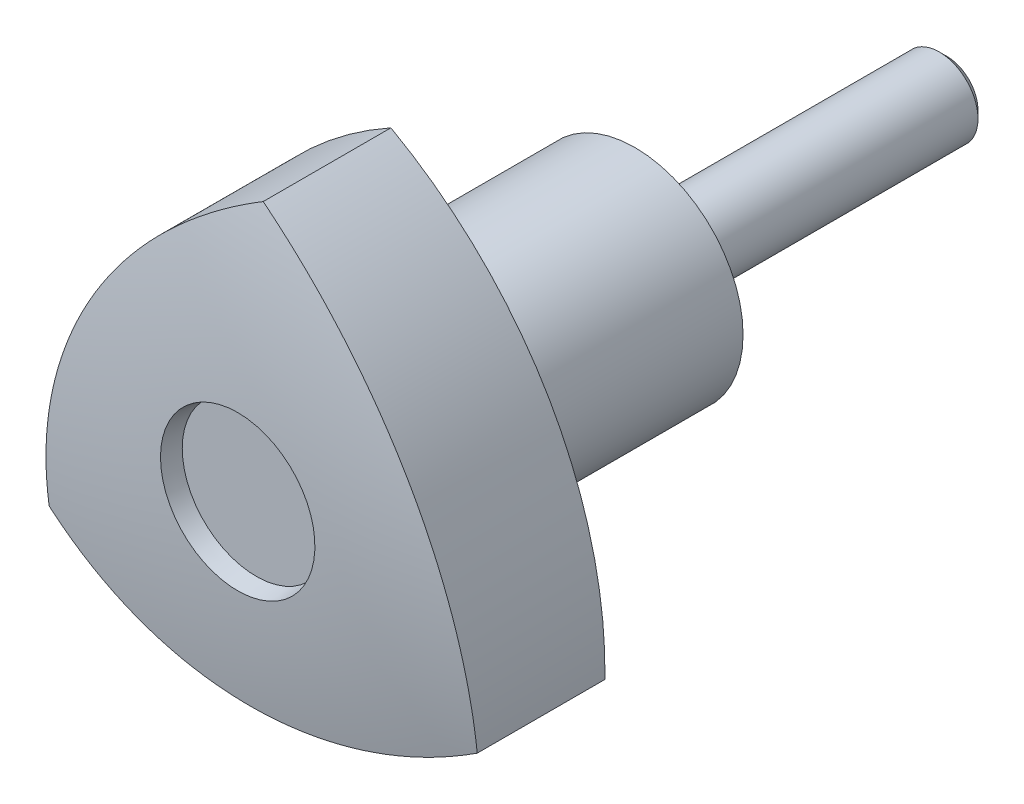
ISO-10303-21;
HEADER;
FILE_DESCRIPTION(('STEP AP214'),'2;1');
FILE_NAME('part.step','',(''),(''),'','','');
FILE_SCHEMA(('AUTOMOTIVE_DESIGN { 1 0 10303 214 1 1 1 1 }'));
ENDSEC;
DATA;
#1=APPLICATION_CONTEXT('core data for automotive mechanical design processes');
#2=APPLICATION_PROTOCOL_DEFINITION('international standard','automotive_design',2000,#1);
#3=PRODUCT_CONTEXT('',#1,'mechanical');
#4=PRODUCT('Part','Part','',(#3));
#5=PRODUCT_RELATED_PRODUCT_CATEGORY('part','',(#4));
#6=PRODUCT_DEFINITION_FORMATION('','',#4);
#7=PRODUCT_DEFINITION_CONTEXT('part definition',#1,'design');
#8=PRODUCT_DEFINITION('design','',#6,#7);
#9=PRODUCT_DEFINITION_SHAPE('','',#8);
#10=(LENGTH_UNIT() NAMED_UNIT(*) SI_UNIT(.MILLI.,.METRE.));
#11=(NAMED_UNIT(*) PLANE_ANGLE_UNIT() SI_UNIT($,.RADIAN.));
#12=(NAMED_UNIT(*) SI_UNIT($,.STERADIAN.) SOLID_ANGLE_UNIT());
#13=UNCERTAINTY_MEASURE_WITH_UNIT(LENGTH_MEASURE(1.E-05),#10,'distance_accuracy_value','');
#14=(GEOMETRIC_REPRESENTATION_CONTEXT(3) GLOBAL_UNCERTAINTY_ASSIGNED_CONTEXT((#13)) GLOBAL_UNIT_ASSIGNED_CONTEXT((#10,
#11,#12)) REPRESENTATION_CONTEXT('',''));
#15=CARTESIAN_POINT('',(0.,0.,0.));
#16=DIRECTION('',(0.,0.,1.));
#17=DIRECTION('',(1.,0.,0.));
#18=AXIS2_PLACEMENT_3D('',#15,#16,#17);
#19=CARTESIAN_POINT('',(0.,-3.25,16.));
#20=DIRECTION('',(0.,0.,-1.));
#21=DIRECTION('',(1.,0.,0.));
#22=AXIS2_PLACEMENT_3D('',#19,#20,#21);
#23=PLANE('',#22);
#24=CARTESIAN_POINT('',(0.,0.,16.0000000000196));
#25=DIRECTION('',(0.,0.,1.));
#26=DIRECTION('',(-1.,0.,0.));
#27=AXIS2_PLACEMENT_3D('',#24,#25,#26);
#28=CIRCLE('',#27,3.2499999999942);
#29=CARTESIAN_POINT('',(-3.2499999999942,0.,16.0000000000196));
#30=VERTEX_POINT('',#29);
#31=EDGE_CURVE('E19',#30,#30,#28,.T.);
#32=ORIENTED_EDGE('',*,*,#31,.T.);
#33=EDGE_LOOP('',(#32));
#34=FACE_BOUND('',#33,.T.);
#35=ADVANCED_FACE('F14',(#34),#23,.F.);
#36=CARTESIAN_POINT('',(0.,0.,23.8666666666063));
#37=DIRECTION('',(0.,0.,1.));
#38=DIRECTION('',(-1.,0.,0.));
#39=AXIS2_PLACEMENT_3D('',#36,#37,#38);
#40=CONICAL_SURFACE('',#39,4.63710558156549,0.174532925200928);
#41=CARTESIAN_POINT('',(0.,0.,23.8666666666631));
#42=DIRECTION('',(0.,0.,1.));
#43=DIRECTION('',(-1.,0.,0.));
#44=AXIS2_PLACEMENT_3D('',#41,#42,#43);
#45=CIRCLE('',#44,4.63710558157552);
#46=CARTESIAN_POINT('',(-4.63710558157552,0.,23.8666666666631));
#47=VERTEX_POINT('',#46);
#48=EDGE_CURVE('E138',#47,#47,#45,.T.);
#49=ORIENTED_EDGE('',*,*,#48,.T.);
#50=EDGE_LOOP('',(#49));
#51=FACE_BOUND('',#50,.T.);
#52=ORIENTED_EDGE('',*,*,#31,.F.);
#53=EDGE_LOOP('',(#52));
#54=FACE_BOUND('',#53,.T.);
#55=ADVANCED_FACE('F146',(#51,#54),#40,.F.);
#56=CARTESIAN_POINT('',(0.,-0.000999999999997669,23.8666666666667));
#57=DIRECTION('',(0.,0.,1.));
#58=DIRECTION('',(-1.,0.,0.));
#59=AXIS2_PLACEMENT_3D('',#56,#57,#58);
#60=PLANE('',#59);
#61=CARTESIAN_POINT('',(0.,0.,23.8666666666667));
#62=DIRECTION('',(0.,0.,-1.));
#63=DIRECTION('',(1.,0.,0.));
#64=AXIS2_PLACEMENT_3D('',#61,#62,#63);
#65=CIRCLE('',#64,0.0009999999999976);
#66=CARTESIAN_POINT('',(0.0009999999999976,0.,23.8666666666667));
#67=VERTEX_POINT('',#66);
#68=EDGE_CURVE('E136',#67,#67,#65,.F.);
#69=ORIENTED_EDGE('',*,*,#68,.T.);
#70=EDGE_LOOP('',(#69));
#71=FACE_BOUND('',#70,.T.);
#72=ORIENTED_EDGE('',*,*,#48,.F.);
#73=EDGE_LOOP('',(#72));
#74=FACE_BOUND('',#73,.T.);
#75=ADVANCED_FACE('F148',(#71,#74),#60,.F.);
#76=CARTESIAN_POINT('',(0.,0.,16.));
#77=DIRECTION('',(0.,0.,-1.));
#78=DIRECTION('',(1.,0.,0.));
#79=AXIS2_PLACEMENT_3D('',#76,#77,#78);
#80=CYLINDRICAL_SURFACE('',#79,0.0009999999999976);
#81=CARTESIAN_POINT('',(0.,0.,24.72));
#82=DIRECTION('',(0.,0.,-1.));
#83=DIRECTION('',(1.,0.,0.));
#84=AXIS2_PLACEMENT_3D('',#81,#82,#83);
#85=CIRCLE('',#84,0.0009999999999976);
#86=CARTESIAN_POINT('',(0.0009999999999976,0.,24.72));
#87=VERTEX_POINT('',#86);
#88=EDGE_CURVE('E133',#87,#87,#85,.F.);
#89=ORIENTED_EDGE('',*,*,#88,.T.);
#90=EDGE_LOOP('',(#89));
#91=FACE_BOUND('',#90,.T.);
#92=ORIENTED_EDGE('',*,*,#68,.F.);
#93=EDGE_LOOP('',(#92));
#94=FACE_BOUND('',#93,.T.);
#95=ADVANCED_FACE('F155',(#91,#94),#80,.F.);
#96=CARTESIAN_POINT('',(0.,0.,-20.));
#97=DIRECTION('',(0.,0.,1.));
#98=DIRECTION('',(-1.,0.,0.));
#99=AXIS2_PLACEMENT_3D('',#96,#97,#98);
#100=PLANE('',#99);
#101=CARTESIAN_POINT('',(0.,0.,-20.0000000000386));
#102=DIRECTION('',(0.,0.,1.));
#103=DIRECTION('',(-1.,0.,0.));
#104=AXIS2_PLACEMENT_3D('',#101,#102,#103);
#105=CIRCLE('',#104,2.00949999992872);
#106=CARTESIAN_POINT('',(-2.00949999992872,0.,-20.0000000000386));
#107=VERTEX_POINT('',#106);
#108=EDGE_CURVE('E130',#107,#107,#105,.T.);
#109=ORIENTED_EDGE('',*,*,#108,.F.);
#110=EDGE_LOOP('',(#109));
#111=FACE_BOUND('',#110,.T.);
#112=ADVANCED_FACE('F211',(#111),#100,.F.);
#113=CARTESIAN_POINT('',(0.,-4.78757127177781,24.72));
#114=DIRECTION('',(0.,0.,-1.));
#115=DIRECTION('',(1.,0.,0.));
#116=AXIS2_PLACEMENT_3D('',#113,#114,#115);
#117=PLANE('',#116);
#118=CARTESIAN_POINT('',(0.,0.,24.7200000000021));
#119=DIRECTION('',(0.,0.,1.));
#120=DIRECTION('',(-1.,0.,0.));
#121=AXIS2_PLACEMENT_3D('',#118,#119,#120);
#122=CIRCLE('',#121,4.78757127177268);
#123=CARTESIAN_POINT('',(-4.78757127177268,0.,24.7200000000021));
#124=VERTEX_POINT('',#123);
#125=EDGE_CURVE('E82',#124,#124,#122,.T.);
#126=ORIENTED_EDGE('',*,*,#125,.T.);
#127=EDGE_LOOP('',(#126));
#128=FACE_BOUND('',#127,.T.);
#129=ORIENTED_EDGE('',*,*,#88,.F.);
#130=EDGE_LOOP('',(#129));
#131=FACE_BOUND('',#130,.T.);
#132=ADVANCED_FACE('F207',(#128,#131),#117,.F.);
#133=CARTESIAN_POINT('',(0.,0.,-19.5094999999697));
#134=DIRECTION('',(0.,0.,1.));
#135=DIRECTION('',(-1.,0.,0.));
#136=AXIS2_PLACEMENT_3D('',#133,#134,#135);
#137=CONICAL_SURFACE('',#136,2.49999999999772,0.785398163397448);
#138=ORIENTED_EDGE('',*,*,#108,.T.);
#139=EDGE_LOOP('',(#138));
#140=FACE_BOUND('',#139,.T.);
#141=CARTESIAN_POINT('',(0.,0.,-19.5095));
#142=DIRECTION('',(0.,0.,-1.));
#143=DIRECTION('',(1.,0.,0.));
#144=AXIS2_PLACEMENT_3D('',#141,#142,#143);
#145=CIRCLE('',#144,2.5);
#146=CARTESIAN_POINT('',(2.5,0.,-19.5095));
#147=VERTEX_POINT('',#146);
#148=EDGE_CURVE('E77',#147,#147,#145,.F.);
#149=ORIENTED_EDGE('',*,*,#148,.F.);
#150=EDGE_LOOP('',(#149));
#151=FACE_BOUND('',#150,.T.);
#152=ADVANCED_FACE('F201',(#140,#151),#137,.T.);
#153=CARTESIAN_POINT('',(0.,0.,25.9170998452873));
#154=DIRECTION('',(0.,0.,1.));
#155=DIRECTION('',(-1.,0.,0.));
#156=AXIS2_PLACEMENT_3D('',#153,#154,#155);
#157=CONICAL_SURFACE('',#156,4.99865227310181,0.174532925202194);
#158=CARTESIAN_POINT('',(0.,0.,25.917099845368));
#159=DIRECTION('',(0.,0.,-1.));
#160=DIRECTION('',(0.,1.,0.));
#161=AXIS2_PLACEMENT_3D('',#158,#159,#160);
#162=CIRCLE('',#161,4.9986522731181);
#163=CARTESIAN_POINT('',(0.,4.9986522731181,25.917099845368));
#164=VERTEX_POINT('',#163);
#165=EDGE_CURVE('E74',#164,#164,#162,.T.);
#166=ORIENTED_EDGE('',*,*,#165,.F.);
#167=EDGE_LOOP('',(#166));
#168=FACE_BOUND('',#167,.T.);
#169=ORIENTED_EDGE('',*,*,#125,.F.);
#170=EDGE_LOOP('',(#169));
#171=FACE_BOUND('',#170,.T.);
#172=ADVANCED_FACE('F196',(#168,#171),#157,.F.);
#173=CARTESIAN_POINT('',(0.,0.,16.));
#174=DIRECTION('',(0.,0.,-1.));
#175=DIRECTION('',(1.,0.,0.));
#176=AXIS2_PLACEMENT_3D('',#173,#174,#175);
#177=CYLINDRICAL_SURFACE('',#176,2.5);
#178=ORIENTED_EDGE('',*,*,#148,.T.);
#179=EDGE_LOOP('',(#178));
#180=FACE_BOUND('',#179,.T.);
#181=CARTESIAN_POINT('',(0.,0.,0.));
#182=DIRECTION('',(0.,0.,-1.));
#183=DIRECTION('',(1.,0.,0.));
#184=AXIS2_PLACEMENT_3D('',#181,#182,#183);
#185=CIRCLE('',#184,2.5);
#186=CARTESIAN_POINT('',(2.5,0.,0.));
#187=VERTEX_POINT('',#186);
#188=EDGE_CURVE('E59',#187,#187,#185,.T.);
#189=ORIENTED_EDGE('',*,*,#188,.T.);
#190=EDGE_LOOP('',(#189));
#191=FACE_BOUND('',#190,.T.);
#192=ADVANCED_FACE('F191',(#180,#191),#177,.T.);
#193=CARTESIAN_POINT('',(0.,0.,-34.969444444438));
#194=DIRECTION('',(0.,0.,1.));
#195=DIRECTION('',(0.,-1.,0.));
#196=AXIS2_PLACEMENT_3D('',#193,#194,#195);
#197=DEGENERATE_TOROIDAL_SURFACE('',#196,1.4888657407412,60.987620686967,.T.);
#198=ORIENTED_EDGE('',*,*,#165,.T.);
#199=EDGE_LOOP('',(#198));
#200=FACE_BOUND('',#199,.T.);
#201=CARTESIAN_POINT('',(0.,16.,24.2666666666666));
#202=CARTESIAN_POINT('',(0.298468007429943,15.8344141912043,24.3072305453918));
#203=CARTESIAN_POINT('',(0.593899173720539,15.6630883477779,24.3464180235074));
#204=CARTESIAN_POINT('',(1.17828931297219,15.3091538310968,24.4220135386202));
#205=CARTESIAN_POINT('',(1.46724825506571,15.126545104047,24.4584215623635));
#206=CARTESIAN_POINT('',(2.32368013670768,14.5621816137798,24.5634194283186));
#207=CARTESIAN_POINT('',(2.88084921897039,14.1638112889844,24.6278022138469));
#208=CARTESIAN_POINT('',(3.9638795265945,13.3251525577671,24.745116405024));
#209=CARTESIAN_POINT('',(4.48974088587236,12.8848643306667,24.7980478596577));
#210=CARTESIAN_POINT('',(5.50690924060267,11.964847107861,24.8923618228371));
#211=CARTESIAN_POINT('',(5.99821484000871,11.4851165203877,24.9337438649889));
#212=CARTESIAN_POINT('',(6.98285633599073,10.4471495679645,25.007906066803));
#213=CARTESIAN_POINT('',(7.47289244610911,9.88570379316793,25.0396709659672));
#214=CARTESIAN_POINT('',(8.40500958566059,8.72373702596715,25.0895862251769));
#215=CARTESIAN_POINT('',(8.84708705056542,8.12321313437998,25.1077355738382));
#216=CARTESIAN_POINT('',(9.6801106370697,6.88720904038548,25.1304492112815));
#217=CARTESIAN_POINT('',(10.0710498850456,6.25172415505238,25.1350116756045));
#218=CARTESIAN_POINT('',(10.6167727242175,5.27607530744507,25.1316729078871));
#219=CARTESIAN_POINT('',(10.7919029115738,4.94711423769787,25.1288627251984));
#220=CARTESIAN_POINT('',(11.1283886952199,4.28215813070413,25.1198463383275));
#221=CARTESIAN_POINT('',(11.2897407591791,3.9461613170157,25.1136392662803));
#222=CARTESIAN_POINT('',(11.750377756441,2.93355634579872,25.0900304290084));
#223=CARTESIAN_POINT('',(12.0289414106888,2.2475052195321,25.0676243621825));
#224=CARTESIAN_POINT('',(12.5284636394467,0.855302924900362,25.0093712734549));
#225=CARTESIAN_POINT('',(12.7494224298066,0.149151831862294,24.9735243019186));
#226=CARTESIAN_POINT('',(13.0365040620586,-0.920875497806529,24.9097113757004));
#227=CARTESIAN_POINT('',(13.1247838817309,-1.27923423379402,24.8867756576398));
#228=CARTESIAN_POINT('',(13.2864817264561,-1.9989639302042,24.837568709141));
#229=CARTESIAN_POINT('',(13.3599033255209,-2.36033414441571,24.8112982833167));
#230=CARTESIAN_POINT('',(13.5576933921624,-3.44789900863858,24.7275082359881));
#231=CARTESIAN_POINT('',(13.6596925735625,-4.17794132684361,24.6649864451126));
#232=CARTESIAN_POINT('',(13.7820705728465,-5.42455627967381,24.5473880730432));
#233=CARTESIAN_POINT('',(13.8177034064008,-5.94002787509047,24.4956294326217));
#234=CARTESIAN_POINT('',(13.859244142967,-6.97051741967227,24.3858387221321));
#235=CARTESIAN_POINT('',(13.8652079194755,-7.48553439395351,24.3278186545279));
#236=CARTESIAN_POINT('',(13.8564064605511,-8.00000000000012,24.2666666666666));
#237=B_SPLINE_CURVE_WITH_KNOTS('',3,(#201,#202,#203,#204,#205,#206,#207,#208,#209,#210,#211,
#212,#213,#214,#215,#216,#217,#218,#219,#220,#221,#222,#223,#224,#225,#226,#227,#228,#229,#230,
#231,#232,#233,#234,#235,#236),.UNSPECIFIED.,.F.,.F.,(4,2,2,2,2,2,2,2,2,2,2,2,2,2,2,2,2,4),(0.,
1.03104347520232,2.06209186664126,4.12370256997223,6.18530445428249,8.24698957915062,
10.481950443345,12.7170773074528,14.9525042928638,16.0702694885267,17.1883203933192,
19.407883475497,21.627438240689,22.7365014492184,23.845297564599,26.0616695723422,
27.6187214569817,29.1728399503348),.UNSPECIFIED.);
#238=CARTESIAN_POINT('',(0.,16.,24.2666666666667));
#239=VERTEX_POINT('',#238);
#240=CARTESIAN_POINT('',(13.856406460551,-8.00000000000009,24.2666666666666));
#241=VERTEX_POINT('',#240);
#242=EDGE_CURVE('E49',#239,#241,#237,.T.);
#243=ORIENTED_EDGE('',*,*,#242,.F.);
#244=CARTESIAN_POINT('',(-13.8564064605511,-7.99999999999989,24.2666666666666));
#245=CARTESIAN_POINT('',(-13.8622389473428,-7.6587262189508,24.3072305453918));
#246=CARTESIAN_POINT('',(-13.861581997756,-7.31721240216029,24.3464180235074));
#247=CARTESIAN_POINT('',(-13.8472607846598,-6.63414843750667,24.4220135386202));
#248=CARTESIAN_POINT('',(-13.8335964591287,-6.29259828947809,24.4584215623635));
#249=CARTESIAN_POINT('',(-13.7730592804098,-5.26872477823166,24.5634194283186));
#250=CARTESIAN_POINT('',(-13.7066450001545,-4.5870170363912,24.6278022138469));
#251=CARTESIAN_POINT('',(-13.5218603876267,-3.22975591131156,24.745116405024));
#252=CARTESIAN_POINT('',(-13.4034902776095,-2.55420250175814,24.7980478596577));
#253=CARTESIAN_POINT('',(-13.1153161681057,-1.21330025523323,24.8923618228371));
#254=CARTESIAN_POINT('',(-12.9455100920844,-0.547951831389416,24.9337438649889));
#255=CARTESIAN_POINT('',(-12.5389250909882,0.823756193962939,25.007906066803));
#256=CARTESIAN_POINT('',(-12.2977168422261,1.52886280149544,25.0396709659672));
#257=CARTESIAN_POINT('',(-11.7574826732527,2.91708330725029,25.0895862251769));
#258=CARTESIAN_POINT('',(-11.4584524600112,3.60019556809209,25.1077355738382));
#259=CARTESIAN_POINT('',(-10.8045533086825,4.93961720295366,25.1304492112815));
#260=CARTESIAN_POINT('',(-10.4496768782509,5.59592296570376,25.1350116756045));
#261=CARTESIAN_POINT('',(-9.87760161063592,6.55635723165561,25.1316729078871));
#262=CARTESIAN_POINT('',(-9.6802780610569,6.87250495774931,25.1288627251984));
#263=CARTESIAN_POINT('',(-9.27265207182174,7.49638824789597,25.1198463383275));
#264=CARTESIAN_POINT('',(-9.06234632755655,7.80412164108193,25.1136392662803));
#265=CARTESIAN_POINT('',(-8.41572319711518,8.70934746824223,25.0900304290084));
#266=CARTESIAN_POINT('',(-7.96086732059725,9.29361623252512,25.0676243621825));
#267=CARTESIAN_POINT('',(-7.00494588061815,10.4223163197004,25.0093712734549));
#268=CARTESIAN_POINT('',(-6.50388049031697,10.9667477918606,24.9735243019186));
#269=CARTESIAN_POINT('',(-5.7207504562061,11.7503814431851,24.9097113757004));
#270=CARTESIAN_POINT('',(-5.45454259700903,12.0060133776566,24.8867756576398));
#271=CARTESIAN_POINT('',(-4.91208731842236,12.5059126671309,24.837568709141));
#272=CARTESIAN_POINT('',(-4.63584233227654,12.7501827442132,24.8112982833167));
#273=CARTESIAN_POINT('',(-3.79287856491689,13.4652563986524,24.7275082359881));
#274=CARTESIAN_POINT('',(-3.21164296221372,13.9186114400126,24.6649864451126));
#275=CARTESIAN_POINT('',(-2.19323174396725,14.6479013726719,24.5473880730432));
#276=CARTESIAN_POINT('',(-1.76463666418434,14.9364961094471,24.4956294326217));
#277=CARTESIAN_POINT('',(-0.892976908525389,15.4877162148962,24.3858387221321));
#278=CARTESIAN_POINT('',(-0.449941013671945,15.7503894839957,24.3278186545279));
#279=CARTESIAN_POINT('',(0.,16.,24.2666666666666));
#280=B_SPLINE_CURVE_WITH_KNOTS('',3,(#244,#245,#246,#247,#248,#249,#250,#251,#252,#253,#254,
#255,#256,#257,#258,#259,#260,#261,#262,#263,#264,#265,#266,#267,#268,#269,#270,#271,#272,#273,
#274,#275,#276,#277,#278,#279),.UNSPECIFIED.,.F.,.F.,(4,2,2,2,2,2,2,2,2,2,2,2,2,2,2,2,2,4),(0.,
1.03104347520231,2.06209186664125,4.12370256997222,6.18530445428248,8.24698957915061,
10.481950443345,12.7170773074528,14.9525042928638,16.0702694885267,17.1883203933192,
19.407883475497,21.627438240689,22.7365014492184,23.845297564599,26.0616695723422,
27.6187214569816,29.1728399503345),.UNSPECIFIED.);
#281=CARTESIAN_POINT('',(-13.8564064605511,-8.,24.2666666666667));
#282=VERTEX_POINT('',#281);
#283=EDGE_CURVE('E58',#282,#239,#280,.T.);
#284=ORIENTED_EDGE('',*,*,#283,.F.);
#285=CARTESIAN_POINT('',(13.8564064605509,-8.,24.2666666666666));
#286=CARTESIAN_POINT('',(13.5637709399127,-8.17568797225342,24.3072305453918));
#287=CARTESIAN_POINT('',(13.2676828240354,-8.34587594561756,24.3464180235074));
#288=CARTESIAN_POINT('',(12.6689714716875,-8.67500539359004,24.4220135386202));
#289=CARTESIAN_POINT('',(12.3663482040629,-8.83394681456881,24.4584215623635));
#290=CARTESIAN_POINT('',(11.4493791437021,-9.29345683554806,24.5634194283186));
#291=CARTESIAN_POINT('',(10.8257957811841,-9.57679425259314,24.6278022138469));
#292=CARTESIAN_POINT('',(9.55798086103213,-10.0953966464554,24.745116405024));
#293=CARTESIAN_POINT('',(8.91374939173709,-10.3306618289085,24.7980478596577));
#294=CARTESIAN_POINT('',(7.60840692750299,-10.7515468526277,24.8923618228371));
#295=CARTESIAN_POINT('',(6.94729525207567,-10.9371646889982,24.9337438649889));
#296=CARTESIAN_POINT('',(5.55606875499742,-11.2709057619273,25.007906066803));
#297=CARTESIAN_POINT('',(4.82482439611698,-11.4145665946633,25.0396709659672));
#298=CARTESIAN_POINT('',(3.35247308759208,-11.6408203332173,25.0895862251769));
#299=CARTESIAN_POINT('',(2.61136540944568,-11.723408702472,25.1077355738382));
#300=CARTESIAN_POINT('',(1.12444267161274,-11.826826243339,25.1304492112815));
#301=CARTESIAN_POINT('',(0.378626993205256,-11.847647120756,25.1350116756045));
#302=CARTESIAN_POINT('',(-0.73917111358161,-11.8324325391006,25.1316729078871));
#303=CARTESIAN_POINT('',(-1.11162485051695,-11.8196191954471,25.1288627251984));
#304=CARTESIAN_POINT('',(-1.85573662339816,-11.7785463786,25.1198463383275));
#305=CARTESIAN_POINT('',(-2.22739443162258,-11.7502829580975,25.1136392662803));
#306=CARTESIAN_POINT('',(-3.33465455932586,-11.6429038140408,25.0900304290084));
#307=CARTESIAN_POINT('',(-4.06807409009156,-11.5411214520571,25.0676243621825));
#308=CARTESIAN_POINT('',(-5.52351775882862,-11.2776192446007,25.0093712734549));
#309=CARTESIAN_POINT('',(-6.24554193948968,-11.1158996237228,24.9735243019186));
#310=CARTESIAN_POINT('',(-7.31575360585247,-10.8295059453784,24.9097113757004));
#311=CARTESIAN_POINT('',(-7.67024128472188,-10.7267791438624,24.8867756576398));
#312=CARTESIAN_POINT('',(-8.37439440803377,-10.5069487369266,24.837568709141));
#313=CARTESIAN_POINT('',(-8.72406099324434,-10.3898485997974,24.8112982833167));
#314=CARTESIAN_POINT('',(-9.76481482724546,-10.0173573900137,24.727508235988));
#315=CARTESIAN_POINT('',(-10.4480496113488,-9.74067011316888,24.6649864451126));
#316=CARTESIAN_POINT('',(-11.5888388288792,-9.22334509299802,24.5473880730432));
#317=CARTESIAN_POINT('',(-12.0530667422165,-8.99646823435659,24.4956294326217));
#318=CARTESIAN_POINT('',(-12.9662672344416,-8.51719879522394,24.3858387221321));
#319=CARTESIAN_POINT('',(-13.4152669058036,-8.26485509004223,24.3278186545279));
#320=CARTESIAN_POINT('',(-13.8564064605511,-8.,24.2666666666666));
#321=B_SPLINE_CURVE_WITH_KNOTS('',3,(#285,#286,#287,#288,#289,#290,#291,#292,#293,#294,#295,
#296,#297,#298,#299,#300,#301,#302,#303,#304,#305,#306,#307,#308,#309,#310,#311,#312,#313,#314,
#315,#316,#317,#318,#319,#320),.UNSPECIFIED.,.F.,.F.,(4,2,2,2,2,2,2,2,2,2,2,2,2,2,2,2,2,4),(0.,
1.03104347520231,2.06209186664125,4.12370256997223,6.18530445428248,8.24698957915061,
10.481950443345,12.7170773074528,14.9525042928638,16.0702694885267,17.1883203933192,
19.407883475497,21.627438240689,22.7365014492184,23.845297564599,26.0616695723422,
27.6187214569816,29.1728399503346),.UNSPECIFIED.);
#322=EDGE_CURVE('E62',#241,#282,#321,.T.);
#323=ORIENTED_EDGE('',*,*,#322,.F.);
#324=EDGE_LOOP('',(#243,#284,#323));
#325=FACE_BOUND('',#324,.T.);
#326=ADVANCED_FACE('F16',(#200,#325),#197,.T.);
#327=CARTESIAN_POINT('',(0.,-2.5,0.));
#328=DIRECTION('',(0.,0.,1.));
#329=DIRECTION('',(-1.,0.,0.));
#330=AXIS2_PLACEMENT_3D('',#327,#328,#329);
#331=PLANE('',#330);
#332=ORIENTED_EDGE('',*,*,#188,.F.);
#333=EDGE_LOOP('',(#332));
#334=FACE_BOUND('',#333,.T.);
#335=CARTESIAN_POINT('',(0.,0.,0.));
#336=DIRECTION('',(0.,0.,-1.));
#337=DIRECTION('',(1.,0.,0.));
#338=AXIS2_PLACEMENT_3D('',#335,#336,#337);
#339=CIRCLE('',#338,3.25);
#340=CARTESIAN_POINT('',(3.25,0.,0.));
#341=VERTEX_POINT('',#340);
#342=EDGE_CURVE('E94',#341,#341,#339,.F.);
#343=ORIENTED_EDGE('',*,*,#342,.F.);
#344=EDGE_LOOP('',(#343));
#345=FACE_BOUND('',#344,.T.);
#346=ADVANCED_FACE('F119',(#334,#345),#331,.F.);
#347=CARTESIAN_POINT('',(-13.0596630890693,-7.54,32.));
#348=DIRECTION('',(0.,0.,1.));
#349=DIRECTION('',(-1.,0.,0.));
#350=AXIS2_PLACEMENT_3D('',#347,#348,#349);
#351=CYLINDRICAL_SURFACE('',#350,26.92);
#352=DIRECTION('',(0.,0.,1.));
#353=VECTOR('',#352,1.);
#354=CARTESIAN_POINT('',(13.856406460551,-8.,32.));
#355=LINE('',#354,#353);
#356=CARTESIAN_POINT('',(13.856406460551,-8.,16.));
#357=VERTEX_POINT('',#356);
#358=EDGE_CURVE('E54',#357,#241,#355,.T.);
#359=ORIENTED_EDGE('',*,*,#358,.F.);
#360=CARTESIAN_POINT('',(-13.0596630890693,-7.54,16.));
#361=DIRECTION('',(0.,0.,1.));
#362=DIRECTION('',(-1.,0.,0.));
#363=AXIS2_PLACEMENT_3D('',#360,#361,#362);
#364=CIRCLE('',#363,26.92);
#365=CARTESIAN_POINT('',(0.,16.,16.));
#366=VERTEX_POINT('',#365);
#367=EDGE_CURVE('E92',#357,#366,#364,.T.);
#368=ORIENTED_EDGE('',*,*,#367,.T.);
#369=DIRECTION('',(0.,0.,1.));
#370=VECTOR('',#369,1.);
#371=CARTESIAN_POINT('',(0.,16.,32.));
#372=LINE('',#371,#370);
#373=EDGE_CURVE('E56',#239,#366,#372,.F.);
#374=ORIENTED_EDGE('',*,*,#373,.F.);
#375=ORIENTED_EDGE('',*,*,#242,.T.);
#376=EDGE_LOOP('',(#359,#368,#374,#375));
#377=FACE_BOUND('',#376,.T.);
#378=ADVANCED_FACE('F52',(#377),#351,.T.);
#379=CARTESIAN_POINT('',(13.0596630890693,-7.54,32.));
#380=DIRECTION('',(0.,0.,1.));
#381=DIRECTION('',(-1.,0.,0.));
#382=AXIS2_PLACEMENT_3D('',#379,#380,#381);
#383=CYLINDRICAL_SURFACE('',#382,26.92);
#384=ORIENTED_EDGE('',*,*,#373,.T.);
#385=CARTESIAN_POINT('',(13.0596630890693,-7.54,16.));
#386=DIRECTION('',(0.,0.,1.));
#387=DIRECTION('',(-1.,0.,0.));
#388=AXIS2_PLACEMENT_3D('',#385,#386,#387);
#389=CIRCLE('',#388,26.92);
#390=CARTESIAN_POINT('',(-13.8564064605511,-8.,16.));
#391=VERTEX_POINT('',#390);
#392=EDGE_CURVE('E34',#366,#391,#389,.T.);
#393=ORIENTED_EDGE('',*,*,#392,.T.);
#394=DIRECTION('',(0.,0.,1.));
#395=VECTOR('',#394,1.);
#396=CARTESIAN_POINT('',(-13.8564064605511,-8.,32.));
#397=LINE('',#396,#395);
#398=EDGE_CURVE('E64',#282,#391,#397,.F.);
#399=ORIENTED_EDGE('',*,*,#398,.F.);
#400=ORIENTED_EDGE('',*,*,#283,.T.);
#401=EDGE_LOOP('',(#384,#393,#399,#400));
#402=FACE_BOUND('',#401,.T.);
#403=ADVANCED_FACE('F111',(#402),#383,.T.);
#404=CARTESIAN_POINT('',(0.,15.08,32.));
#405=DIRECTION('',(0.,0.,1.));
#406=DIRECTION('',(-1.,0.,0.));
#407=AXIS2_PLACEMENT_3D('',#404,#405,#406);
#408=CYLINDRICAL_SURFACE('',#407,26.92);
#409=ORIENTED_EDGE('',*,*,#398,.T.);
#410=CARTESIAN_POINT('',(0.,15.08,16.));
#411=DIRECTION('',(0.,0.,1.));
#412=DIRECTION('',(-1.,0.,0.));
#413=AXIS2_PLACEMENT_3D('',#410,#411,#412);
#414=CIRCLE('',#413,26.92);
#415=EDGE_CURVE('E68',#391,#357,#414,.T.);
#416=ORIENTED_EDGE('',*,*,#415,.T.);
#417=ORIENTED_EDGE('',*,*,#358,.T.);
#418=ORIENTED_EDGE('',*,*,#322,.T.);
#419=EDGE_LOOP('',(#409,#416,#417,#418));
#420=FACE_BOUND('',#419,.T.);
#421=ADVANCED_FACE('F66',(#420),#408,.T.);
#422=CARTESIAN_POINT('',(0.,0.,16.));
#423=DIRECTION('',(0.,0.,-1.));
#424=DIRECTION('',(1.,0.,0.));
#425=AXIS2_PLACEMENT_3D('',#422,#423,#424);
#426=CYLINDRICAL_SURFACE('',#425,3.25);
#427=ORIENTED_EDGE('',*,*,#342,.T.);
#428=EDGE_LOOP('',(#427));
#429=FACE_BOUND('',#428,.T.);
#430=CARTESIAN_POINT('',(0.,0.,0.200000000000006));
#431=DIRECTION('',(0.,0.,-1.));
#432=DIRECTION('',(1.,0.,0.));
#433=AXIS2_PLACEMENT_3D('',#430,#431,#432);
#434=CIRCLE('',#433,3.25);
#435=CARTESIAN_POINT('',(3.25,0.,0.200000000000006));
#436=VERTEX_POINT('',#435);
#437=EDGE_CURVE('E87',#436,#436,#434,.T.);
#438=ORIENTED_EDGE('',*,*,#437,.T.);
#439=EDGE_LOOP('',(#438));
#440=FACE_BOUND('',#439,.T.);
#441=ADVANCED_FACE('F110',(#429,#440),#426,.T.);
#442=CARTESIAN_POINT('',(0.,-7.,16.));
#443=DIRECTION('',(0.,0.,1.));
#444=DIRECTION('',(-1.,0.,0.));
#445=AXIS2_PLACEMENT_3D('',#442,#443,#444);
#446=PLANE('',#445);
#447=CARTESIAN_POINT('',(0.,0.,16.));
#448=DIRECTION('',(0.,0.,-1.));
#449=DIRECTION('',(1.,0.,0.));
#450=AXIS2_PLACEMENT_3D('',#447,#448,#449);
#451=CIRCLE('',#450,7.);
#452=CARTESIAN_POINT('',(7.,0.,16.));
#453=VERTEX_POINT('',#452);
#454=EDGE_CURVE('E25',#453,#453,#451,.T.);
#455=ORIENTED_EDGE('',*,*,#454,.F.);
#456=EDGE_LOOP('',(#455));
#457=FACE_BOUND('',#456,.T.);
#458=ORIENTED_EDGE('',*,*,#392,.F.);
#459=ORIENTED_EDGE('',*,*,#367,.F.);
#460=ORIENTED_EDGE('',*,*,#415,.F.);
#461=EDGE_LOOP('',(#458,#459,#460));
#462=FACE_BOUND('',#461,.T.);
#463=ADVANCED_FACE('F166',(#457,#462),#446,.F.);
#464=CARTESIAN_POINT('',(0.,-3.25,0.200000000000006));
#465=DIRECTION('',(0.,0.,1.));
#466=DIRECTION('',(-1.,0.,0.));
#467=AXIS2_PLACEMENT_3D('',#464,#465,#466);
#468=PLANE('',#467);
#469=ORIENTED_EDGE('',*,*,#437,.F.);
#470=EDGE_LOOP('',(#469));
#471=FACE_BOUND('',#470,.T.);
#472=CARTESIAN_POINT('',(0.,0.,0.200000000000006));
#473=DIRECTION('',(0.,0.,-1.));
#474=DIRECTION('',(1.,0.,0.));
#475=AXIS2_PLACEMENT_3D('',#472,#473,#474);
#476=CIRCLE('',#475,7.);
#477=CARTESIAN_POINT('',(7.,0.,0.200000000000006));
#478=VERTEX_POINT('',#477);
#479=EDGE_CURVE('E9',#478,#478,#476,.F.);
#480=ORIENTED_EDGE('',*,*,#479,.F.);
#481=EDGE_LOOP('',(#480));
#482=FACE_BOUND('',#481,.T.);
#483=ADVANCED_FACE('F160',(#471,#482),#468,.F.);
#484=CARTESIAN_POINT('',(0.,0.,16.));
#485=DIRECTION('',(0.,0.,-1.));
#486=DIRECTION('',(1.,0.,0.));
#487=AXIS2_PLACEMENT_3D('',#484,#485,#486);
#488=CYLINDRICAL_SURFACE('',#487,7.);
#489=ORIENTED_EDGE('',*,*,#479,.T.);
#490=EDGE_LOOP('',(#489));
#491=FACE_BOUND('',#490,.T.);
#492=ORIENTED_EDGE('',*,*,#454,.T.);
#493=EDGE_LOOP('',(#492));
#494=FACE_BOUND('',#493,.T.);
#495=ADVANCED_FACE('F158',(#491,#494),#488,.T.);
#496=CLOSED_SHELL('',(#35,#55,#75,#95,#112,#132,#152,#172,#192,#326,#346,#378,#403,#421,#441,
#463,#483,#495));
#497=MANIFOLD_SOLID_BREP('B1',#496);
#498=ADVANCED_BREP_SHAPE_REPRESENTATION('',(#18,#497),#14);
#499=SHAPE_DEFINITION_REPRESENTATION(#9,#498);
ENDSEC;
END-ISO-10303-21;
